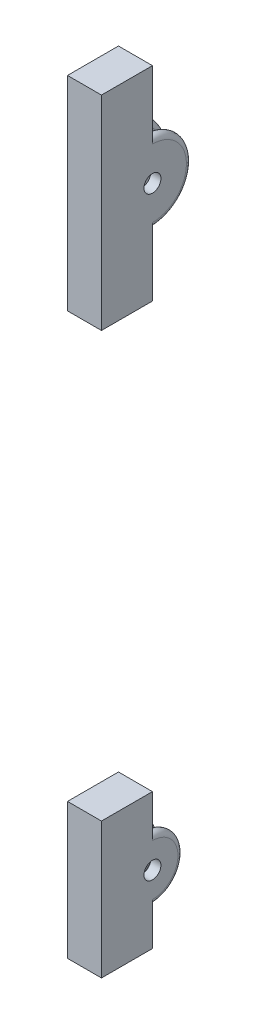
ISO-10303-21;
HEADER;
FILE_DESCRIPTION(('STEP AP214'),'2;1');
FILE_NAME('part.step','',(''),(''),'','','');
FILE_SCHEMA(('AUTOMOTIVE_DESIGN { 1 0 10303 214 1 1 1 1 }'));
ENDSEC;
DATA;
#1=APPLICATION_CONTEXT('core data for automotive mechanical design processes');
#2=APPLICATION_PROTOCOL_DEFINITION('international standard','automotive_design',2000,#1);
#3=PRODUCT_CONTEXT('',#1,'mechanical');
#4=PRODUCT('Part','Part','',(#3));
#5=PRODUCT_RELATED_PRODUCT_CATEGORY('part','',(#4));
#6=PRODUCT_DEFINITION_FORMATION('','',#4);
#7=PRODUCT_DEFINITION_CONTEXT('part definition',#1,'design');
#8=PRODUCT_DEFINITION('design','',#6,#7);
#9=PRODUCT_DEFINITION_SHAPE('','',#8);
#10=(LENGTH_UNIT() NAMED_UNIT(*) SI_UNIT(.MILLI.,.METRE.));
#11=(NAMED_UNIT(*) PLANE_ANGLE_UNIT() SI_UNIT($,.RADIAN.));
#12=(NAMED_UNIT(*) SI_UNIT($,.STERADIAN.) SOLID_ANGLE_UNIT());
#13=UNCERTAINTY_MEASURE_WITH_UNIT(LENGTH_MEASURE(1.E-05),#10,'distance_accuracy_value','');
#14=(GEOMETRIC_REPRESENTATION_CONTEXT(3) GLOBAL_UNCERTAINTY_ASSIGNED_CONTEXT((#13)) GLOBAL_UNIT_ASSIGNED_CONTEXT((#10,
#11,#12)) REPRESENTATION_CONTEXT('',''));
#15=CARTESIAN_POINT('',(0.,0.,0.));
#16=DIRECTION('',(0.,0.,1.));
#17=DIRECTION('',(1.,0.,0.));
#18=AXIS2_PLACEMENT_3D('',#15,#16,#17);
#19=CARTESIAN_POINT('',(0.,0.,0.));
#20=DIRECTION('',(0.,0.,1.));
#21=DIRECTION('',(1.,0.,0.));
#22=AXIS2_PLACEMENT_3D('',#19,#20,#21);
#23=PLANE('',#22);
#24=DIRECTION('',(1.,0.,0.));
#25=VECTOR('',#24,1.);
#26=CARTESIAN_POINT('',(4.00000000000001,-365.,0.));
#27=LINE('',#26,#25);
#28=CARTESIAN_POINT('',(4.00000000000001,-365.,0.));
#29=VERTEX_POINT('',#28);
#30=CARTESIAN_POINT('',(-4.00000000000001,-365.,0.));
#31=VERTEX_POINT('',#30);
#32=EDGE_CURVE('E117',#29,#31,#27,.F.);
#33=ORIENTED_EDGE('',*,*,#32,.F.);
#34=CARTESIAN_POINT('',(7.00000000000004,-365.,0.));
#35=DIRECTION('',(0.,0.,1.));
#36=DIRECTION('',(1.,0.,0.));
#37=AXIS2_PLACEMENT_3D('',#34,#35,#36);
#38=CIRCLE('',#37,3.00000000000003);
#39=CARTESIAN_POINT('',(10.,-365.,0.));
#40=VERTEX_POINT('',#39);
#41=EDGE_CURVE('E134',#40,#29,#38,.F.);
#42=ORIENTED_EDGE('',*,*,#41,.F.);
#43=DIRECTION('',(0.,1.,0.));
#44=VECTOR('',#43,1.);
#45=CARTESIAN_POINT('',(9.99999999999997,-310.,0.));
#46=LINE('',#45,#44);
#47=CARTESIAN_POINT('',(10.0000000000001,-390.,0.));
#48=VERTEX_POINT('',#47);
#49=EDGE_CURVE('E161',#48,#40,#46,.T.);
#50=ORIENTED_EDGE('',*,*,#49,.F.);
#51=DIRECTION('',(1.,0.,0.));
#52=VECTOR('',#51,1.);
#53=CARTESIAN_POINT('',(-10.,-390.,0.));
#54=LINE('',#53,#52);
#55=CARTESIAN_POINT('',(-10.,-390.,0.));
#56=VERTEX_POINT('',#55);
#57=EDGE_CURVE('E159',#56,#48,#54,.T.);
#58=ORIENTED_EDGE('',*,*,#57,.F.);
#59=DIRECTION('',(0.,-1.,0.));
#60=VECTOR('',#59,1.);
#61=CARTESIAN_POINT('',(-10.,-310.,0.));
#62=LINE('',#61,#60);
#63=CARTESIAN_POINT('',(-10.,-365.,0.));
#64=VERTEX_POINT('',#63);
#65=EDGE_CURVE('E70',#64,#56,#62,.T.);
#66=ORIENTED_EDGE('',*,*,#65,.F.);
#67=CARTESIAN_POINT('',(-7.00000000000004,-365.,0.));
#68=DIRECTION('',(0.,0.,1.));
#69=DIRECTION('',(1.,0.,0.));
#70=AXIS2_PLACEMENT_3D('',#67,#68,#69);
#71=CIRCLE('',#70,3.00000000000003);
#72=EDGE_CURVE('E12',#31,#64,#71,.F.);
#73=ORIENTED_EDGE('',*,*,#72,.F.);
#74=EDGE_LOOP('',(#33,#42,#50,#58,#66,#73));
#75=FACE_BOUND('',#74,.T.);
#76=ADVANCED_FACE('F46',(#75),#23,.F.);
#77=DIRECTION('',(1.,0.,0.));
#78=VECTOR('',#77,1.);
#79=CARTESIAN_POINT('',(4.00000000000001,-335.,0.));
#80=LINE('',#79,#78);
#81=CARTESIAN_POINT('',(-4.00000000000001,-335.,0.));
#82=VERTEX_POINT('',#81);
#83=CARTESIAN_POINT('',(4.00000000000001,-335.,0.));
#84=VERTEX_POINT('',#83);
#85=EDGE_CURVE('E109',#82,#84,#80,.T.);
#86=ORIENTED_EDGE('',*,*,#85,.F.);
#87=CARTESIAN_POINT('',(-7.00000000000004,-335.,0.));
#88=DIRECTION('',(0.,0.,1.));
#89=DIRECTION('',(1.,0.,0.));
#90=AXIS2_PLACEMENT_3D('',#87,#88,#89);
#91=CIRCLE('',#90,3.00000000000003);
#92=CARTESIAN_POINT('',(-10.,-335.,0.));
#93=VERTEX_POINT('',#92);
#94=EDGE_CURVE('E55',#93,#82,#91,.F.);
#95=ORIENTED_EDGE('',*,*,#94,.F.);
#96=CARTESIAN_POINT('',(-10.,-310.,0.));
#97=VERTEX_POINT('',#96);
#98=EDGE_CURVE('E141',#97,#93,#62,.T.);
#99=ORIENTED_EDGE('',*,*,#98,.F.);
#100=DIRECTION('',(-1.,0.,0.));
#101=VECTOR('',#100,1.);
#102=CARTESIAN_POINT('',(-10.,-310.,0.));
#103=LINE('',#102,#101);
#104=CARTESIAN_POINT('',(9.99999999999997,-310.,0.));
#105=VERTEX_POINT('',#104);
#106=EDGE_CURVE('E151',#105,#97,#103,.T.);
#107=ORIENTED_EDGE('',*,*,#106,.F.);
#108=CARTESIAN_POINT('',(10.0000000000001,-335.,0.));
#109=VERTEX_POINT('',#108);
#110=EDGE_CURVE('E130',#109,#105,#46,.T.);
#111=ORIENTED_EDGE('',*,*,#110,.F.);
#112=CARTESIAN_POINT('',(7.00000000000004,-335.,0.));
#113=DIRECTION('',(0.,0.,1.));
#114=DIRECTION('',(1.,0.,0.));
#115=AXIS2_PLACEMENT_3D('',#112,#113,#114);
#116=CIRCLE('',#115,3.00000000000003);
#117=EDGE_CURVE('E127',#84,#109,#116,.F.);
#118=ORIENTED_EDGE('',*,*,#117,.F.);
#119=EDGE_LOOP('',(#86,#95,#99,#107,#111,#118));
#120=FACE_BOUND('',#119,.T.);
#121=ADVANCED_FACE('F128',(#120),#23,.F.);
#122=CARTESIAN_POINT('',(-10.,-310.,30.));
#123=DIRECTION('',(1.,0.,0.));
#124=DIRECTION('',(0.,0.,-1.));
#125=AXIS2_PLACEMENT_3D('',#122,#123,#124);
#126=PLANE('',#125);
#127=CARTESIAN_POINT('',(-10.0000000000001,-350.,0.));
#128=DIRECTION('',(1.,0.,0.));
#129=DIRECTION('',(0.,0.,-1.));
#130=AXIS2_PLACEMENT_3D('',#127,#128,#129);
#131=CIRCLE('',#130,5.);
#132=CARTESIAN_POINT('',(-10.0000000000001,-350.,-5.));
#133=VERTEX_POINT('',#132);
#134=EDGE_CURVE('E192',#133,#133,#131,.T.);
#135=ORIENTED_EDGE('',*,*,#134,.T.);
#136=EDGE_LOOP('',(#135));
#137=FACE_BOUND('',#136,.T.);
#138=ORIENTED_EDGE('',*,*,#98,.T.);
#139=CARTESIAN_POINT('',(-10.0000000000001,-350.,0.));
#140=DIRECTION('',(1.,0.,0.));
#141=DIRECTION('',(0.,0.,-1.));
#142=AXIS2_PLACEMENT_3D('',#139,#140,#141);
#143=CIRCLE('',#142,15.);
#144=EDGE_CURVE('E143',#64,#93,#143,.T.);
#145=ORIENTED_EDGE('',*,*,#144,.F.);
#146=ORIENTED_EDGE('',*,*,#65,.T.);
#147=DIRECTION('',(0.,0.,-1.));
#148=VECTOR('',#147,1.);
#149=CARTESIAN_POINT('',(-10.,-390.,30.));
#150=LINE('',#149,#148);
#151=CARTESIAN_POINT('',(-10.,-390.,30.));
#152=VERTEX_POINT('',#151);
#153=EDGE_CURVE('E135',#152,#56,#150,.T.);
#154=ORIENTED_EDGE('',*,*,#153,.F.);
#155=DIRECTION('',(0.,-1.,0.));
#156=VECTOR('',#155,1.);
#157=CARTESIAN_POINT('',(-10.,-310.,30.));
#158=LINE('',#157,#156);
#159=CARTESIAN_POINT('',(-10.,-310.,30.));
#160=VERTEX_POINT('',#159);
#161=EDGE_CURVE('E147',#160,#152,#158,.T.);
#162=ORIENTED_EDGE('',*,*,#161,.F.);
#163=DIRECTION('',(0.,0.,-1.));
#164=VECTOR('',#163,1.);
#165=CARTESIAN_POINT('',(-10.,-310.,30.));
#166=LINE('',#165,#164);
#167=EDGE_CURVE('E156',#160,#97,#166,.T.);
#168=ORIENTED_EDGE('',*,*,#167,.T.);
#169=EDGE_LOOP('',(#138,#145,#146,#154,#162,#168));
#170=FACE_BOUND('',#169,.T.);
#171=ADVANCED_FACE('F48',(#137,#170),#126,.F.);
#172=CARTESIAN_POINT('',(-10.,-390.,30.));
#173=DIRECTION('',(0.,1.,0.));
#174=DIRECTION('',(0.,0.,1.));
#175=AXIS2_PLACEMENT_3D('',#172,#173,#174);
#176=PLANE('',#175);
#177=ORIENTED_EDGE('',*,*,#57,.T.);
#178=DIRECTION('',(0.,0.,-1.));
#179=VECTOR('',#178,1.);
#180=CARTESIAN_POINT('',(10.0000000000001,-390.,30.));
#181=LINE('',#180,#179);
#182=CARTESIAN_POINT('',(10.0000000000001,-390.,30.));
#183=VERTEX_POINT('',#182);
#184=EDGE_CURVE('E170',#183,#48,#181,.T.);
#185=ORIENTED_EDGE('',*,*,#184,.F.);
#186=DIRECTION('',(1.,0.,0.));
#187=VECTOR('',#186,1.);
#188=CARTESIAN_POINT('',(-10.,-390.,30.));
#189=LINE('',#188,#187);
#190=EDGE_CURVE('E150',#152,#183,#189,.T.);
#191=ORIENTED_EDGE('',*,*,#190,.F.);
#192=ORIENTED_EDGE('',*,*,#153,.T.);
#193=EDGE_LOOP('',(#177,#185,#191,#192));
#194=FACE_BOUND('',#193,.T.);
#195=ADVANCED_FACE('F206',(#194),#176,.F.);
#196=CARTESIAN_POINT('',(9.99999999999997,-310.,30.));
#197=DIRECTION('',(-1.,0.,0.));
#198=DIRECTION('',(0.,-1.,0.));
#199=AXIS2_PLACEMENT_3D('',#196,#197,#198);
#200=PLANE('',#199);
#201=CARTESIAN_POINT('',(10.0000000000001,-350.,0.));
#202=DIRECTION('',(1.,0.,0.));
#203=DIRECTION('',(0.,0.,-1.));
#204=AXIS2_PLACEMENT_3D('',#201,#202,#203);
#205=CIRCLE('',#204,5.);
#206=CARTESIAN_POINT('',(10.0000000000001,-350.,-5.));
#207=VERTEX_POINT('',#206);
#208=EDGE_CURVE('E195',#207,#207,#205,.T.);
#209=ORIENTED_EDGE('',*,*,#208,.F.);
#210=EDGE_LOOP('',(#209));
#211=FACE_BOUND('',#210,.T.);
#212=ORIENTED_EDGE('',*,*,#49,.T.);
#213=CARTESIAN_POINT('',(10.0000000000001,-350.,0.));
#214=DIRECTION('',(1.,0.,0.));
#215=DIRECTION('',(0.,0.,-1.));
#216=AXIS2_PLACEMENT_3D('',#213,#214,#215);
#217=CIRCLE('',#216,15.);
#218=EDGE_CURVE('E139',#40,#109,#217,.T.);
#219=ORIENTED_EDGE('',*,*,#218,.T.);
#220=ORIENTED_EDGE('',*,*,#110,.T.);
#221=DIRECTION('',(0.,0.,-1.));
#222=VECTOR('',#221,1.);
#223=CARTESIAN_POINT('',(9.99999999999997,-310.,30.));
#224=LINE('',#223,#222);
#225=CARTESIAN_POINT('',(9.99999999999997,-310.,30.));
#226=VERTEX_POINT('',#225);
#227=EDGE_CURVE('E167',#226,#105,#224,.T.);
#228=ORIENTED_EDGE('',*,*,#227,.F.);
#229=DIRECTION('',(0.,1.,0.));
#230=VECTOR('',#229,1.);
#231=CARTESIAN_POINT('',(9.99999999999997,-310.,30.));
#232=LINE('',#231,#230);
#233=EDGE_CURVE('E153',#183,#226,#232,.T.);
#234=ORIENTED_EDGE('',*,*,#233,.F.);
#235=ORIENTED_EDGE('',*,*,#184,.T.);
#236=EDGE_LOOP('',(#212,#219,#220,#228,#234,#235));
#237=FACE_BOUND('',#236,.T.);
#238=ADVANCED_FACE('F202',(#211,#237),#200,.F.);
#239=CARTESIAN_POINT('',(-10.,-310.,30.));
#240=DIRECTION('',(0.,-1.,0.));
#241=DIRECTION('',(0.,0.,-1.));
#242=AXIS2_PLACEMENT_3D('',#239,#240,#241);
#243=PLANE('',#242);
#244=ORIENTED_EDGE('',*,*,#106,.T.);
#245=ORIENTED_EDGE('',*,*,#167,.F.);
#246=DIRECTION('',(-1.,0.,0.));
#247=VECTOR('',#246,1.);
#248=CARTESIAN_POINT('',(-10.,-310.,30.));
#249=LINE('',#248,#247);
#250=EDGE_CURVE('E155',#226,#160,#249,.T.);
#251=ORIENTED_EDGE('',*,*,#250,.F.);
#252=ORIENTED_EDGE('',*,*,#227,.T.);
#253=EDGE_LOOP('',(#244,#245,#251,#252));
#254=FACE_BOUND('',#253,.T.);
#255=ADVANCED_FACE('F205',(#254),#243,.F.);
#256=CARTESIAN_POINT('',(0.,0.,30.));
#257=DIRECTION('',(0.,0.,1.));
#258=DIRECTION('',(1.,0.,0.));
#259=AXIS2_PLACEMENT_3D('',#256,#257,#258);
#260=PLANE('',#259);
#261=ORIENTED_EDGE('',*,*,#161,.T.);
#262=ORIENTED_EDGE('',*,*,#190,.T.);
#263=ORIENTED_EDGE('',*,*,#233,.T.);
#264=ORIENTED_EDGE('',*,*,#250,.T.);
#265=EDGE_LOOP('',(#261,#262,#263,#264));
#266=FACE_BOUND('',#265,.T.);
#267=ADVANCED_FACE('F219',(#266),#260,.T.);
#268=CARTESIAN_POINT('',(4.00000000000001,-350.,0.));
#269=DIRECTION('',(1.,0.,0.));
#270=DIRECTION('',(0.,0.,-1.));
#271=AXIS2_PLACEMENT_3D('',#268,#269,#270);
#272=PLANE('',#271);
#273=CARTESIAN_POINT('',(4.00000000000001,-350.,0.));
#274=DIRECTION('',(1.,0.,0.));
#275=DIRECTION('',(0.,0.,-1.));
#276=AXIS2_PLACEMENT_3D('',#273,#274,#275);
#277=CIRCLE('',#276,5.);
#278=CARTESIAN_POINT('',(4.00000000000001,-350.,-5.));
#279=VERTEX_POINT('',#278);
#280=EDGE_CURVE('E124',#279,#279,#277,.T.);
#281=ORIENTED_EDGE('',*,*,#280,.T.);
#282=EDGE_LOOP('',(#281));
#283=FACE_BOUND('',#282,.T.);
#284=CARTESIAN_POINT('',(4.00000000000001,-350.,0.));
#285=DIRECTION('',(1.,0.,0.));
#286=DIRECTION('',(0.,0.,-1.));
#287=AXIS2_PLACEMENT_3D('',#284,#285,#286);
#288=CIRCLE('',#287,15.);
#289=EDGE_CURVE('E123',#29,#84,#288,.T.);
#290=ORIENTED_EDGE('',*,*,#289,.F.);
#291=CARTESIAN_POINT('',(4.00000000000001,-350.,0.));
#292=DIRECTION('',(1.,0.,0.));
#293=DIRECTION('',(0.,0.,-1.));
#294=AXIS2_PLACEMENT_3D('',#291,#292,#293);
#295=CIRCLE('',#294,15.);
#296=EDGE_CURVE('E112',#84,#29,#295,.T.);
#297=ORIENTED_EDGE('',*,*,#296,.F.);
#298=EDGE_LOOP('',(#290,#297));
#299=FACE_BOUND('',#298,.T.);
#300=ADVANCED_FACE('F121',(#283,#299),#272,.F.);
#301=CARTESIAN_POINT('',(7.00000000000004,-350.,0.));
#302=DIRECTION('',(1.,0.,0.));
#303=DIRECTION('',(0.,0.,-1.));
#304=AXIS2_PLACEMENT_3D('',#301,#302,#303);
#305=TOROIDAL_SURFACE('',#304,15.,3.00000000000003);
#306=ORIENTED_EDGE('',*,*,#218,.F.);
#307=ORIENTED_EDGE('',*,*,#41,.T.);
#308=ORIENTED_EDGE('',*,*,#289,.T.);
#309=ORIENTED_EDGE('',*,*,#117,.T.);
#310=EDGE_LOOP('',(#306,#307,#308,#309));
#311=FACE_BOUND('',#310,.T.);
#312=ADVANCED_FACE('F138',(#311),#305,.T.);
#313=CARTESIAN_POINT('',(-7.00000000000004,-350.,0.));
#314=DIRECTION('',(1.,0.,0.));
#315=DIRECTION('',(0.,0.,-1.));
#316=AXIS2_PLACEMENT_3D('',#313,#314,#315);
#317=TOROIDAL_SURFACE('',#316,15.,3.00000000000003);
#318=CARTESIAN_POINT('',(-4.00000000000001,-350.,0.));
#319=DIRECTION('',(1.,0.,0.));
#320=DIRECTION('',(0.,0.,-1.));
#321=AXIS2_PLACEMENT_3D('',#318,#319,#320);
#322=CIRCLE('',#321,15.);
#323=EDGE_CURVE('E181',#31,#82,#322,.T.);
#324=ORIENTED_EDGE('',*,*,#323,.F.);
#325=ORIENTED_EDGE('',*,*,#72,.T.);
#326=ORIENTED_EDGE('',*,*,#144,.T.);
#327=ORIENTED_EDGE('',*,*,#94,.T.);
#328=EDGE_LOOP('',(#324,#325,#326,#327));
#329=FACE_BOUND('',#328,.T.);
#330=ADVANCED_FACE('F180',(#329),#317,.T.);
#331=CARTESIAN_POINT('',(-4.00000000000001,-350.,0.));
#332=DIRECTION('',(-1.,0.,0.));
#333=DIRECTION('',(0.,0.,1.));
#334=AXIS2_PLACEMENT_3D('',#331,#332,#333);
#335=PLANE('',#334);
#336=CARTESIAN_POINT('',(-4.00000000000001,-350.,0.));
#337=DIRECTION('',(-1.,0.,0.));
#338=DIRECTION('',(0.,0.,1.));
#339=AXIS2_PLACEMENT_3D('',#336,#337,#338);
#340=CIRCLE('',#339,5.);
#341=CARTESIAN_POINT('',(-4.00000000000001,-350.,5.));
#342=VERTEX_POINT('',#341);
#343=EDGE_CURVE('E50',#342,#342,#340,.T.);
#344=ORIENTED_EDGE('',*,*,#343,.T.);
#345=EDGE_LOOP('',(#344));
#346=FACE_BOUND('',#345,.T.);
#347=ORIENTED_EDGE('',*,*,#323,.T.);
#348=CARTESIAN_POINT('',(-4.00000000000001,-350.,0.));
#349=DIRECTION('',(1.,0.,0.));
#350=DIRECTION('',(0.,0.,-1.));
#351=AXIS2_PLACEMENT_3D('',#348,#349,#350);
#352=CIRCLE('',#351,15.);
#353=EDGE_CURVE('E62',#82,#31,#352,.T.);
#354=ORIENTED_EDGE('',*,*,#353,.T.);
#355=EDGE_LOOP('',(#347,#354));
#356=FACE_BOUND('',#355,.T.);
#357=ADVANCED_FACE('F185',(#346,#356),#335,.F.);
#358=CARTESIAN_POINT('',(4.00000000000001,-350.,0.));
#359=DIRECTION('',(1.,0.,0.));
#360=DIRECTION('',(0.,0.,-1.));
#361=AXIS2_PLACEMENT_3D('',#358,#359,#360);
#362=CYLINDRICAL_SURFACE('',#361,15.);
#363=ORIENTED_EDGE('',*,*,#32,.T.);
#364=ORIENTED_EDGE('',*,*,#353,.F.);
#365=ORIENTED_EDGE('',*,*,#85,.T.);
#366=ORIENTED_EDGE('',*,*,#296,.T.);
#367=EDGE_LOOP('',(#363,#364,#365,#366));
#368=FACE_BOUND('',#367,.T.);
#369=ADVANCED_FACE('F111',(#368),#362,.F.);
#370=CARTESIAN_POINT('',(-10.0000000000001,-350.,0.));
#371=DIRECTION('',(1.,0.,0.));
#372=DIRECTION('',(0.,0.,-1.));
#373=AXIS2_PLACEMENT_3D('',#370,#371,#372);
#374=CYLINDRICAL_SURFACE('',#373,5.);
#375=ORIENTED_EDGE('',*,*,#134,.F.);
#376=EDGE_LOOP('',(#375));
#377=FACE_BOUND('',#376,.T.);
#378=ORIENTED_EDGE('',*,*,#343,.F.);
#379=EDGE_LOOP('',(#378));
#380=FACE_BOUND('',#379,.T.);
#381=ADVANCED_FACE('F254',(#377,#380),#374,.F.);
#382=ORIENTED_EDGE('',*,*,#208,.T.);
#383=EDGE_LOOP('',(#382));
#384=FACE_BOUND('',#383,.T.);
#385=ORIENTED_EDGE('',*,*,#280,.F.);
#386=EDGE_LOOP('',(#385));
#387=FACE_BOUND('',#386,.T.);
#388=ADVANCED_FACE('F199',(#384,#387),#374,.F.);
#389=CLOSED_SHELL('',(#76,#121,#171,#195,#238,#255,#267,#300,#312,#330,#357,#369,#381,#388));
#390=MANIFOLD_SOLID_BREP('B2',#389);
#391=CARTESIAN_POINT('',(0.,0.,0.));
#392=DIRECTION('',(0.,0.,1.));
#393=DIRECTION('',(1.,0.,0.));
#394=AXIS2_PLACEMENT_3D('',#391,#392,#393);
#395=PLANE('',#394);
#396=DIRECTION('',(1.,0.,0.));
#397=VECTOR('',#396,1.);
#398=CARTESIAN_POINT('',(34.6789119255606,-20.,0.));
#399=LINE('',#398,#397);
#400=CARTESIAN_POINT('',(4.00000000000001,-20.,1.39659253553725E-13));
#401=VERTEX_POINT('',#400);
#402=CARTESIAN_POINT('',(-4.,-20.,1.39659253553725E-13));
#403=VERTEX_POINT('',#402);
#404=EDGE_CURVE('E426',#401,#403,#399,.F.);
#405=ORIENTED_EDGE('',*,*,#404,.F.);
#406=CARTESIAN_POINT('',(7.,-20.,1.39659253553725E-13));
#407=DIRECTION('',(0.,0.,1.));
#408=DIRECTION('',(-1.,0.,0.));
#409=AXIS2_PLACEMENT_3D('',#406,#407,#408);
#410=CIRCLE('',#409,3.);
#411=CARTESIAN_POINT('',(10.,-20.,0.));
#412=VERTEX_POINT('',#411);
#413=EDGE_CURVE('E444',#401,#412,#410,.T.);
#414=ORIENTED_EDGE('',*,*,#413,.T.);
#415=DIRECTION('',(0.,1.,0.));
#416=VECTOR('',#415,1.);
#417=CARTESIAN_POINT('',(10.,60.,0.));
#418=LINE('',#417,#416);
#419=CARTESIAN_POINT('',(10.,-60.,0.));
#420=VERTEX_POINT('',#419);
#421=EDGE_CURVE('E468',#420,#412,#418,.T.);
#422=ORIENTED_EDGE('',*,*,#421,.F.);
#423=DIRECTION('',(1.,0.,0.));
#424=VECTOR('',#423,1.);
#425=CARTESIAN_POINT('',(-10.,-60.,0.));
#426=LINE('',#425,#424);
#427=CARTESIAN_POINT('',(-10.,-60.,0.));
#428=VERTEX_POINT('',#427);
#429=EDGE_CURVE('E466',#428,#420,#426,.T.);
#430=ORIENTED_EDGE('',*,*,#429,.F.);
#431=DIRECTION('',(0.,-1.,0.));
#432=VECTOR('',#431,1.);
#433=CARTESIAN_POINT('',(-10.,60.,0.));
#434=LINE('',#433,#432);
#435=CARTESIAN_POINT('',(-10.,-20.,0.));
#436=VERTEX_POINT('',#435);
#437=EDGE_CURVE('E366',#436,#428,#434,.T.);
#438=ORIENTED_EDGE('',*,*,#437,.F.);
#439=CARTESIAN_POINT('',(-7.00000000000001,-20.,1.39659253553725E-13));
#440=DIRECTION('',(0.,0.,1.));
#441=DIRECTION('',(1.,0.,0.));
#442=AXIS2_PLACEMENT_3D('',#439,#440,#441);
#443=CIRCLE('',#442,3.);
#444=EDGE_CURVE('E502',#436,#403,#443,.T.);
#445=ORIENTED_EDGE('',*,*,#444,.T.);
#446=EDGE_LOOP('',(#405,#414,#422,#430,#438,#445));
#447=FACE_BOUND('',#446,.T.);
#448=ADVANCED_FACE('F351',(#447),#395,.F.);
#449=DIRECTION('',(1.,0.,0.));
#450=VECTOR('',#449,1.);
#451=CARTESIAN_POINT('',(34.6789119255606,20.,0.));
#452=LINE('',#451,#450);
#453=CARTESIAN_POINT('',(-4.,20.,-1.39659253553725E-13));
#454=VERTEX_POINT('',#453);
#455=CARTESIAN_POINT('',(4.00000000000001,20.,0.));
#456=VERTEX_POINT('',#455);
#457=EDGE_CURVE('E417',#454,#456,#452,.T.);
#458=ORIENTED_EDGE('',*,*,#457,.F.);
#459=CARTESIAN_POINT('',(-7.,20.,0.));
#460=DIRECTION('',(0.,0.,-1.));
#461=DIRECTION('',(1.,0.,0.));
#462=AXIS2_PLACEMENT_3D('',#459,#460,#461);
#463=CIRCLE('',#462,3.);
#464=CARTESIAN_POINT('',(-10.,20.,0.));
#465=VERTEX_POINT('',#464);
#466=EDGE_CURVE('E374',#465,#454,#463,.T.);
#467=ORIENTED_EDGE('',*,*,#466,.F.);
#468=CARTESIAN_POINT('',(-10.,60.,0.));
#469=VERTEX_POINT('',#468);
#470=EDGE_CURVE('E450',#469,#465,#434,.T.);
#471=ORIENTED_EDGE('',*,*,#470,.F.);
#472=DIRECTION('',(-1.,0.,0.));
#473=VECTOR('',#472,1.);
#474=CARTESIAN_POINT('',(-10.,60.,0.));
#475=LINE('',#474,#473);
#476=CARTESIAN_POINT('',(10.,60.,0.));
#477=VERTEX_POINT('',#476);
#478=EDGE_CURVE('E459',#477,#469,#475,.T.);
#479=ORIENTED_EDGE('',*,*,#478,.F.);
#480=CARTESIAN_POINT('',(10.,20.,0.));
#481=VERTEX_POINT('',#480);
#482=EDGE_CURVE('E440',#481,#477,#418,.T.);
#483=ORIENTED_EDGE('',*,*,#482,.F.);
#484=CARTESIAN_POINT('',(7.,20.,0.));
#485=DIRECTION('',(0.,0.,-1.));
#486=DIRECTION('',(-1.,0.,0.));
#487=AXIS2_PLACEMENT_3D('',#484,#485,#486);
#488=CIRCLE('',#487,3.);
#489=EDGE_CURVE('E437',#456,#481,#488,.T.);
#490=ORIENTED_EDGE('',*,*,#489,.F.);
#491=EDGE_LOOP('',(#458,#467,#471,#479,#483,#490));
#492=FACE_BOUND('',#491,.T.);
#493=ADVANCED_FACE('F438',(#492),#395,.F.);
#494=CARTESIAN_POINT('',(-10.,0.,0.));
#495=DIRECTION('',(1.,0.,0.));
#496=DIRECTION('',(0.,0.,-1.));
#497=AXIS2_PLACEMENT_3D('',#494,#495,#496);
#498=CYLINDRICAL_SURFACE('',#497,5.);
#499=CARTESIAN_POINT('',(-10.,0.,0.));
#500=DIRECTION('',(1.,0.,0.));
#501=DIRECTION('',(0.,0.,-1.));
#502=AXIS2_PLACEMENT_3D('',#499,#500,#501);
#503=CIRCLE('',#502,5.);
#504=CARTESIAN_POINT('',(-10.,0.,-5.));
#505=VERTEX_POINT('',#504);
#506=EDGE_CURVE('E512',#505,#505,#503,.T.);
#507=CARTESIAN_POINT('',(-4.00000000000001,0.,0.));
#508=DIRECTION('',(-1.,0.,0.));
#509=DIRECTION('',(0.,-1.,0.));
#510=AXIS2_PLACEMENT_3D('',#507,#508,#509);
#511=CIRCLE('',#510,5.);
#512=CARTESIAN_POINT('',(-4.,0.,-5.));
#513=VERTEX_POINT('',#512);
#514=EDGE_CURVE('E44',#513,#513,#511,.T.);
#515=CARTESIAN_POINT('',(-10.,0.,-5.));
#516=CARTESIAN_POINT('',(-9.93750000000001,0.,-5.));
#517=CARTESIAN_POINT('',(-9.87500000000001,0.,-5.));
#518=CARTESIAN_POINT('',(-9.75000000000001,0.,-5.));
#519=CARTESIAN_POINT('',(-9.68750000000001,0.,-5.));
#520=CARTESIAN_POINT('',(-9.56250000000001,0.,-5.));
#521=CARTESIAN_POINT('',(-9.50000000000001,0.,-5.));
#522=CARTESIAN_POINT('',(-9.37500000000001,0.,-5.));
#523=CARTESIAN_POINT('',(-9.31250000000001,0.,-5.));
#524=CARTESIAN_POINT('',(-9.18750000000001,0.,-5.));
#525=CARTESIAN_POINT('',(-9.12500000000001,0.,-5.));
#526=CARTESIAN_POINT('',(-9.00000000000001,0.,-5.));
#527=CARTESIAN_POINT('',(-8.93750000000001,0.,-5.));
#528=CARTESIAN_POINT('',(-8.81250000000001,0.,-5.));
#529=CARTESIAN_POINT('',(-8.75000000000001,0.,-5.));
#530=CARTESIAN_POINT('',(-8.62500000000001,0.,-5.));
#531=CARTESIAN_POINT('',(-8.56250000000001,0.,-5.));
#532=CARTESIAN_POINT('',(-8.43750000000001,0.,-5.));
#533=CARTESIAN_POINT('',(-8.37500000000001,0.,-5.));
#534=CARTESIAN_POINT('',(-8.25000000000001,0.,-5.));
#535=CARTESIAN_POINT('',(-8.18750000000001,0.,-5.));
#536=CARTESIAN_POINT('',(-8.06250000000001,0.,-5.));
#537=CARTESIAN_POINT('',(-8.00000000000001,0.,-5.));
#538=CARTESIAN_POINT('',(-7.87500000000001,0.,-5.));
#539=CARTESIAN_POINT('',(-7.81250000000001,0.,-5.));
#540=CARTESIAN_POINT('',(-7.68750000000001,0.,-5.));
#541=CARTESIAN_POINT('',(-7.62500000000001,0.,-5.));
#542=CARTESIAN_POINT('',(-7.50000000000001,0.,-5.));
#543=CARTESIAN_POINT('',(-7.43750000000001,0.,-5.));
#544=CARTESIAN_POINT('',(-7.31250000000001,0.,-5.));
#545=CARTESIAN_POINT('',(-7.25000000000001,0.,-5.));
#546=CARTESIAN_POINT('',(-7.12500000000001,0.,-5.));
#547=CARTESIAN_POINT('',(-7.06250000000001,0.,-5.));
#548=CARTESIAN_POINT('',(-6.93750000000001,0.,-5.));
#549=CARTESIAN_POINT('',(-6.87500000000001,0.,-5.));
#550=CARTESIAN_POINT('',(-6.75000000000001,0.,-5.));
#551=CARTESIAN_POINT('',(-6.68750000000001,0.,-5.));
#552=CARTESIAN_POINT('',(-6.56250000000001,0.,-5.));
#553=CARTESIAN_POINT('',(-6.50000000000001,0.,-5.));
#554=CARTESIAN_POINT('',(-6.37500000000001,0.,-5.));
#555=CARTESIAN_POINT('',(-6.31250000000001,0.,-5.));
#556=CARTESIAN_POINT('',(-6.18750000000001,0.,-5.));
#557=CARTESIAN_POINT('',(-6.12500000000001,0.,-5.));
#558=CARTESIAN_POINT('',(-6.00000000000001,0.,-5.));
#559=CARTESIAN_POINT('',(-5.93750000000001,0.,-5.));
#560=CARTESIAN_POINT('',(-5.81250000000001,0.,-5.));
#561=CARTESIAN_POINT('',(-5.75000000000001,0.,-5.));
#562=CARTESIAN_POINT('',(-5.62500000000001,0.,-5.));
#563=CARTESIAN_POINT('',(-5.56250000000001,0.,-5.));
#564=CARTESIAN_POINT('',(-5.43750000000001,0.,-5.));
#565=CARTESIAN_POINT('',(-5.37500000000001,0.,-5.));
#566=CARTESIAN_POINT('',(-5.25000000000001,0.,-5.));
#567=CARTESIAN_POINT('',(-5.18750000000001,0.,-5.));
#568=CARTESIAN_POINT('',(-5.06250000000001,0.,-5.));
#569=CARTESIAN_POINT('',(-5.00000000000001,0.,-5.));
#570=CARTESIAN_POINT('',(-4.87500000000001,0.,-5.));
#571=CARTESIAN_POINT('',(-4.81250000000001,0.,-5.));
#572=CARTESIAN_POINT('',(-4.68750000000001,0.,-5.));
#573=CARTESIAN_POINT('',(-4.62500000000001,0.,-5.));
#574=CARTESIAN_POINT('',(-4.5,0.,-5.));
#575=CARTESIAN_POINT('',(-4.4375,0.,-5.));
#576=CARTESIAN_POINT('',(-4.3125,0.,-5.));
#577=CARTESIAN_POINT('',(-4.25,0.,-5.));
#578=CARTESIAN_POINT('',(-4.125,0.,-5.));
#579=CARTESIAN_POINT('',(-4.0625,0.,-5.));
#580=CARTESIAN_POINT('',(-4.,0.,-5.));
#581=B_SPLINE_CURVE_WITH_KNOTS('',3,(#515,#516,#517,#518,#519,#520,#521,#522,#523,#524,#525,
#526,#527,#528,#529,#530,#531,#532,#533,#534,#535,#536,#537,#538,#539,#540,#541,#542,#543,#544,
#545,#546,#547,#548,#549,#550,#551,#552,#553,#554,#555,#556,#557,#558,#559,#560,#561,#562,#563,
#564,#565,#566,#567,#568,#569,#570,#571,#572,#573,#574,#575,#576,#577,#578,#579,#580),
.UNSPECIFIED.,.F.,.F.,(4,2,2,2,2,2,2,2,2,2,2,2,2,2,2,2,2,2,2,2,2,2,2,2,2,2,2,2,2,2,2,2,4),(0.,
0.1875,0.375,0.5625,0.750000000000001,0.937500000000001,1.125,1.3125,1.5,1.6875,1.875,2.0625,
2.25,2.4375,2.625,2.8125,3.,3.1875,3.375,3.5625,3.75,3.9375,4.125,4.3125,4.5,4.6875,4.875,
5.0625,5.25,5.4375,5.625,5.8125,6.),.UNSPECIFIED.);
#582=EDGE_CURVE('BSEAM536',#505,#513,#581,.T.);
#583=ORIENTED_EDGE('',*,*,#506,.F.);
#584=ORIENTED_EDGE('',*,*,#514,.F.);
#585=ORIENTED_EDGE('',*,*,#582,.T.);
#586=ORIENTED_EDGE('',*,*,#582,.F.);
#587=EDGE_LOOP('',(#583,#585,#584,#586));
#588=FACE_BOUND('',#587,.T.);
#589=ADVANCED_FACE('F536',(#588),#498,.F.);
#590=CARTESIAN_POINT('',(10.,0.,0.));
#591=DIRECTION('',(1.,0.,0.));
#592=DIRECTION('',(0.,0.,-1.));
#593=AXIS2_PLACEMENT_3D('',#590,#591,#592);
#594=CIRCLE('',#593,5.);
#595=CARTESIAN_POINT('',(10.,0.,-5.));
#596=VERTEX_POINT('',#595);
#597=EDGE_CURVE('E513',#596,#596,#594,.T.);
#598=CARTESIAN_POINT('',(4.,0.,0.));
#599=DIRECTION('',(1.,0.,0.));
#600=DIRECTION('',(0.,1.,0.));
#601=AXIS2_PLACEMENT_3D('',#598,#599,#600);
#602=CIRCLE('',#601,5.);
#603=CARTESIAN_POINT('',(4.,0.,-5.));
#604=VERTEX_POINT('',#603);
#605=EDGE_CURVE('E509',#604,#604,#602,.T.);
#606=CARTESIAN_POINT('',(10.,0.,-5.));
#607=CARTESIAN_POINT('',(9.9375,0.,-5.));
#608=CARTESIAN_POINT('',(9.875,0.,-5.));
#609=CARTESIAN_POINT('',(9.75,0.,-5.));
#610=CARTESIAN_POINT('',(9.6875,0.,-5.));
#611=CARTESIAN_POINT('',(9.5625,0.,-5.));
#612=CARTESIAN_POINT('',(9.5,0.,-5.));
#613=CARTESIAN_POINT('',(9.375,0.,-5.));
#614=CARTESIAN_POINT('',(9.3125,0.,-5.));
#615=CARTESIAN_POINT('',(9.1875,0.,-5.));
#616=CARTESIAN_POINT('',(9.125,0.,-5.));
#617=CARTESIAN_POINT('',(9.,0.,-5.));
#618=CARTESIAN_POINT('',(8.9375,0.,-5.));
#619=CARTESIAN_POINT('',(8.8125,0.,-5.));
#620=CARTESIAN_POINT('',(8.75,0.,-5.));
#621=CARTESIAN_POINT('',(8.625,0.,-5.));
#622=CARTESIAN_POINT('',(8.5625,0.,-5.));
#623=CARTESIAN_POINT('',(8.4375,0.,-5.));
#624=CARTESIAN_POINT('',(8.375,0.,-5.));
#625=CARTESIAN_POINT('',(8.25,0.,-5.));
#626=CARTESIAN_POINT('',(8.1875,0.,-5.));
#627=CARTESIAN_POINT('',(8.0625,0.,-5.));
#628=CARTESIAN_POINT('',(8.,0.,-5.));
#629=CARTESIAN_POINT('',(7.875,0.,-5.));
#630=CARTESIAN_POINT('',(7.8125,0.,-5.));
#631=CARTESIAN_POINT('',(7.6875,0.,-5.));
#632=CARTESIAN_POINT('',(7.625,0.,-5.));
#633=CARTESIAN_POINT('',(7.5,0.,-5.));
#634=CARTESIAN_POINT('',(7.4375,0.,-5.));
#635=CARTESIAN_POINT('',(7.3125,0.,-5.));
#636=CARTESIAN_POINT('',(7.25,0.,-5.));
#637=CARTESIAN_POINT('',(7.125,0.,-5.));
#638=CARTESIAN_POINT('',(7.0625,0.,-5.));
#639=CARTESIAN_POINT('',(6.9375,0.,-5.));
#640=CARTESIAN_POINT('',(6.875,0.,-5.));
#641=CARTESIAN_POINT('',(6.75,0.,-5.));
#642=CARTESIAN_POINT('',(6.6875,0.,-5.));
#643=CARTESIAN_POINT('',(6.5625,0.,-5.));
#644=CARTESIAN_POINT('',(6.5,0.,-5.));
#645=CARTESIAN_POINT('',(6.375,0.,-5.));
#646=CARTESIAN_POINT('',(6.3125,0.,-5.));
#647=CARTESIAN_POINT('',(6.1875,0.,-5.));
#648=CARTESIAN_POINT('',(6.125,0.,-5.));
#649=CARTESIAN_POINT('',(6.,0.,-5.));
#650=CARTESIAN_POINT('',(5.9375,0.,-5.));
#651=CARTESIAN_POINT('',(5.8125,0.,-5.));
#652=CARTESIAN_POINT('',(5.75,0.,-5.));
#653=CARTESIAN_POINT('',(5.625,0.,-5.));
#654=CARTESIAN_POINT('',(5.5625,0.,-5.));
#655=CARTESIAN_POINT('',(5.4375,0.,-5.));
#656=CARTESIAN_POINT('',(5.375,0.,-5.));
#657=CARTESIAN_POINT('',(5.25,0.,-5.));
#658=CARTESIAN_POINT('',(5.1875,0.,-5.));
#659=CARTESIAN_POINT('',(5.0625,0.,-5.));
#660=CARTESIAN_POINT('',(5.,0.,-5.));
#661=CARTESIAN_POINT('',(4.875,0.,-5.));
#662=CARTESIAN_POINT('',(4.8125,0.,-5.));
#663=CARTESIAN_POINT('',(4.6875,0.,-5.));
#664=CARTESIAN_POINT('',(4.625,0.,-5.));
#665=CARTESIAN_POINT('',(4.5,0.,-5.));
#666=CARTESIAN_POINT('',(4.4375,0.,-5.));
#667=CARTESIAN_POINT('',(4.3125,0.,-5.));
#668=CARTESIAN_POINT('',(4.25,0.,-5.));
#669=CARTESIAN_POINT('',(4.125,0.,-5.));
#670=CARTESIAN_POINT('',(4.0625,0.,-5.));
#671=CARTESIAN_POINT('',(4.,0.,-5.));
#672=B_SPLINE_CURVE_WITH_KNOTS('',3,(#606,#607,#608,#609,#610,#611,#612,#613,#614,#615,#616,
#617,#618,#619,#620,#621,#622,#623,#624,#625,#626,#627,#628,#629,#630,#631,#632,#633,#634,#635,
#636,#637,#638,#639,#640,#641,#642,#643,#644,#645,#646,#647,#648,#649,#650,#651,#652,#653,#654,
#655,#656,#657,#658,#659,#660,#661,#662,#663,#664,#665,#666,#667,#668,#669,#670,#671),
.UNSPECIFIED.,.F.,.F.,(4,2,2,2,2,2,2,2,2,2,2,2,2,2,2,2,2,2,2,2,2,2,2,2,2,2,2,2,2,2,2,2,4),(0.,
0.1875,0.375,0.5625,0.750000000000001,0.937500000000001,1.125,1.3125,1.5,1.6875,1.875,2.0625,
2.25,2.4375,2.625,2.8125,3.,3.1875,3.375,3.5625,3.75,3.9375,4.125,4.3125,4.5,4.6875,4.875,
5.0625,5.25,5.4375,5.625,5.8125,6.),.UNSPECIFIED.);
#673=EDGE_CURVE('BSEAM548',#596,#604,#672,.T.);
#674=ORIENTED_EDGE('',*,*,#597,.T.);
#675=ORIENTED_EDGE('',*,*,#605,.F.);
#676=ORIENTED_EDGE('',*,*,#673,.T.);
#677=ORIENTED_EDGE('',*,*,#673,.F.);
#678=EDGE_LOOP('',(#674,#676,#675,#677));
#679=FACE_BOUND('',#678,.T.);
#680=ADVANCED_FACE('F548',(#679),#498,.F.);
#681=CARTESIAN_POINT('',(-10.,60.,30.));
#682=DIRECTION('',(1.,0.,0.));
#683=DIRECTION('',(0.,0.,-1.));
#684=AXIS2_PLACEMENT_3D('',#681,#682,#683);
#685=PLANE('',#684);
#686=ORIENTED_EDGE('',*,*,#506,.T.);
#687=EDGE_LOOP('',(#686));
#688=FACE_BOUND('',#687,.T.);
#689=ORIENTED_EDGE('',*,*,#470,.T.);
#690=CARTESIAN_POINT('',(-10.,0.,0.));
#691=DIRECTION('',(1.,0.,0.));
#692=DIRECTION('',(0.,1.,0.));
#693=AXIS2_PLACEMENT_3D('',#690,#691,#692);
#694=CIRCLE('',#693,20.);
#695=EDGE_CURVE('E445',#436,#465,#694,.T.);
#696=ORIENTED_EDGE('',*,*,#695,.F.);
#697=ORIENTED_EDGE('',*,*,#437,.T.);
#698=DIRECTION('',(0.,0.,-1.));
#699=VECTOR('',#698,1.);
#700=CARTESIAN_POINT('',(-10.,-60.,30.));
#701=LINE('',#700,#699);
#702=CARTESIAN_POINT('',(-10.,-60.,30.));
#703=VERTEX_POINT('',#702);
#704=EDGE_CURVE('E359',#703,#428,#701,.T.);
#705=ORIENTED_EDGE('',*,*,#704,.F.);
#706=DIRECTION('',(0.,-1.,0.));
#707=VECTOR('',#706,1.);
#708=CARTESIAN_POINT('',(-10.,60.,30.));
#709=LINE('',#708,#707);
#710=CARTESIAN_POINT('',(-10.,60.,30.));
#711=VERTEX_POINT('',#710);
#712=EDGE_CURVE('E455',#711,#703,#709,.T.);
#713=ORIENTED_EDGE('',*,*,#712,.F.);
#714=DIRECTION('',(0.,0.,-1.));
#715=VECTOR('',#714,1.);
#716=CARTESIAN_POINT('',(-10.,60.,30.));
#717=LINE('',#716,#715);
#718=EDGE_CURVE('E464',#711,#469,#717,.T.);
#719=ORIENTED_EDGE('',*,*,#718,.T.);
#720=EDGE_LOOP('',(#689,#696,#697,#705,#713,#719));
#721=FACE_BOUND('',#720,.T.);
#722=ADVANCED_FACE('F353',(#688,#721),#685,.F.);
#723=CARTESIAN_POINT('',(-10.,-60.,30.));
#724=DIRECTION('',(0.,1.,0.));
#725=DIRECTION('',(0.,0.,1.));
#726=AXIS2_PLACEMENT_3D('',#723,#724,#725);
#727=PLANE('',#726);
#728=ORIENTED_EDGE('',*,*,#429,.T.);
#729=DIRECTION('',(0.,0.,-1.));
#730=VECTOR('',#729,1.);
#731=CARTESIAN_POINT('',(10.,-60.,30.));
#732=LINE('',#731,#730);
#733=CARTESIAN_POINT('',(10.,-60.,30.));
#734=VERTEX_POINT('',#733);
#735=EDGE_CURVE('E477',#734,#420,#732,.T.);
#736=ORIENTED_EDGE('',*,*,#735,.F.);
#737=DIRECTION('',(1.,0.,0.));
#738=VECTOR('',#737,1.);
#739=CARTESIAN_POINT('',(-10.,-60.,30.));
#740=LINE('',#739,#738);
#741=EDGE_CURVE('E458',#703,#734,#740,.T.);
#742=ORIENTED_EDGE('',*,*,#741,.F.);
#743=ORIENTED_EDGE('',*,*,#704,.T.);
#744=EDGE_LOOP('',(#728,#736,#742,#743));
#745=FACE_BOUND('',#744,.T.);
#746=ADVANCED_FACE('F482',(#745),#727,.F.);
#747=CARTESIAN_POINT('',(10.,60.,30.));
#748=DIRECTION('',(-1.,0.,0.));
#749=DIRECTION('',(0.,0.,1.));
#750=AXIS2_PLACEMENT_3D('',#747,#748,#749);
#751=PLANE('',#750);
#752=ORIENTED_EDGE('',*,*,#597,.F.);
#753=EDGE_LOOP('',(#752));
#754=FACE_BOUND('',#753,.T.);
#755=ORIENTED_EDGE('',*,*,#421,.T.);
#756=CARTESIAN_POINT('',(10.,0.,0.));
#757=DIRECTION('',(1.,0.,0.));
#758=DIRECTION('',(0.,1.,0.));
#759=AXIS2_PLACEMENT_3D('',#756,#757,#758);
#760=CIRCLE('',#759,20.);
#761=EDGE_CURVE('E448',#412,#481,#760,.T.);
#762=ORIENTED_EDGE('',*,*,#761,.T.);
#763=ORIENTED_EDGE('',*,*,#482,.T.);
#764=DIRECTION('',(0.,0.,-1.));
#765=VECTOR('',#764,1.);
#766=CARTESIAN_POINT('',(10.,60.,30.));
#767=LINE('',#766,#765);
#768=CARTESIAN_POINT('',(10.,60.,30.));
#769=VERTEX_POINT('',#768);
#770=EDGE_CURVE('E474',#769,#477,#767,.T.);
#771=ORIENTED_EDGE('',*,*,#770,.F.);
#772=DIRECTION('',(0.,1.,0.));
#773=VECTOR('',#772,1.);
#774=CARTESIAN_POINT('',(10.,60.,30.));
#775=LINE('',#774,#773);
#776=EDGE_CURVE('E461',#734,#769,#775,.T.);
#777=ORIENTED_EDGE('',*,*,#776,.F.);
#778=ORIENTED_EDGE('',*,*,#735,.T.);
#779=EDGE_LOOP('',(#755,#762,#763,#771,#777,#778));
#780=FACE_BOUND('',#779,.T.);
#781=ADVANCED_FACE('F490',(#754,#780),#751,.F.);
#782=CARTESIAN_POINT('',(-10.,60.,30.));
#783=DIRECTION('',(0.,-1.,0.));
#784=DIRECTION('',(1.,0.,0.));
#785=AXIS2_PLACEMENT_3D('',#782,#783,#784);
#786=PLANE('',#785);
#787=ORIENTED_EDGE('',*,*,#478,.T.);
#788=ORIENTED_EDGE('',*,*,#718,.F.);
#789=DIRECTION('',(-1.,0.,0.));
#790=VECTOR('',#789,1.);
#791=CARTESIAN_POINT('',(-10.,60.,30.));
#792=LINE('',#791,#790);
#793=EDGE_CURVE('E463',#769,#711,#792,.T.);
#794=ORIENTED_EDGE('',*,*,#793,.F.);
#795=ORIENTED_EDGE('',*,*,#770,.T.);
#796=EDGE_LOOP('',(#787,#788,#794,#795));
#797=FACE_BOUND('',#796,.T.);
#798=ADVANCED_FACE('F498',(#797),#786,.F.);
#799=CARTESIAN_POINT('',(0.,0.,30.));
#800=DIRECTION('',(0.,0.,1.));
#801=DIRECTION('',(1.,0.,0.));
#802=AXIS2_PLACEMENT_3D('',#799,#800,#801);
#803=PLANE('',#802);
#804=ORIENTED_EDGE('',*,*,#712,.T.);
#805=ORIENTED_EDGE('',*,*,#741,.T.);
#806=ORIENTED_EDGE('',*,*,#776,.T.);
#807=ORIENTED_EDGE('',*,*,#793,.T.);
#808=EDGE_LOOP('',(#804,#805,#806,#807));
#809=FACE_BOUND('',#808,.T.);
#810=ADVANCED_FACE('F495',(#809),#803,.T.);
#811=CARTESIAN_POINT('',(4.,0.,0.));
#812=DIRECTION('',(1.,0.,0.));
#813=DIRECTION('',(0.,1.,0.));
#814=AXIS2_PLACEMENT_3D('',#811,#812,#813);
#815=PLANE('',#814);
#816=CARTESIAN_POINT('',(4.,0.,0.));
#817=DIRECTION('',(1.,0.,0.));
#818=DIRECTION('',(0.,1.,0.));
#819=AXIS2_PLACEMENT_3D('',#816,#817,#818);
#820=CIRCLE('',#819,20.);
#821=EDGE_CURVE('E433',#401,#456,#820,.T.);
#822=ORIENTED_EDGE('',*,*,#821,.F.);
#823=CARTESIAN_POINT('',(4.00000000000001,0.,0.));
#824=DIRECTION('',(1.,0.,0.));
#825=DIRECTION('',(0.,0.,-1.));
#826=AXIS2_PLACEMENT_3D('',#823,#824,#825);
#827=CIRCLE('',#826,20.);
#828=EDGE_CURVE('E420',#456,#401,#827,.T.);
#829=ORIENTED_EDGE('',*,*,#828,.F.);
#830=EDGE_LOOP('',(#822,#829));
#831=FACE_BOUND('',#830,.T.);
#832=ORIENTED_EDGE('',*,*,#605,.T.);
#833=EDGE_LOOP('',(#832));
#834=FACE_BOUND('',#833,.T.);
#835=ADVANCED_FACE('F430',(#831,#834),#815,.F.);
#836=CARTESIAN_POINT('',(7.,0.,0.));
#837=DIRECTION('',(1.,0.,0.));
#838=DIRECTION('',(0.,1.,0.));
#839=AXIS2_PLACEMENT_3D('',#836,#837,#838);
#840=TOROIDAL_SURFACE('',#839,20.,3.);
#841=ORIENTED_EDGE('',*,*,#413,.F.);
#842=ORIENTED_EDGE('',*,*,#821,.T.);
#843=ORIENTED_EDGE('',*,*,#489,.T.);
#844=ORIENTED_EDGE('',*,*,#761,.F.);
#845=EDGE_LOOP('',(#841,#842,#843,#844));
#846=FACE_BOUND('',#845,.T.);
#847=ADVANCED_FACE('F447',(#846),#840,.T.);
#848=CARTESIAN_POINT('',(-7.00000000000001,0.,0.));
#849=DIRECTION('',(1.,0.,0.));
#850=DIRECTION('',(0.,1.,0.));
#851=AXIS2_PLACEMENT_3D('',#848,#849,#850);
#852=TOROIDAL_SURFACE('',#851,20.,3.);
#853=ORIENTED_EDGE('',*,*,#695,.T.);
#854=ORIENTED_EDGE('',*,*,#466,.T.);
#855=CARTESIAN_POINT('',(-4.00000000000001,0.,0.));
#856=DIRECTION('',(1.,0.,0.));
#857=DIRECTION('',(0.,1.,0.));
#858=AXIS2_PLACEMENT_3D('',#855,#856,#857);
#859=CIRCLE('',#858,20.);
#860=EDGE_CURVE('E503',#403,#454,#859,.T.);
#861=ORIENTED_EDGE('',*,*,#860,.F.);
#862=ORIENTED_EDGE('',*,*,#444,.F.);
#863=EDGE_LOOP('',(#853,#854,#861,#862));
#864=FACE_BOUND('',#863,.T.);
#865=ADVANCED_FACE('F500',(#864),#852,.T.);
#866=CARTESIAN_POINT('',(-4.00000000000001,0.,0.));
#867=DIRECTION('',(-1.,0.,0.));
#868=DIRECTION('',(0.,-1.,0.));
#869=AXIS2_PLACEMENT_3D('',#866,#867,#868);
#870=PLANE('',#869);
#871=ORIENTED_EDGE('',*,*,#514,.T.);
#872=EDGE_LOOP('',(#871));
#873=FACE_BOUND('',#872,.T.);
#874=ORIENTED_EDGE('',*,*,#860,.T.);
#875=CARTESIAN_POINT('',(-4.,0.,0.));
#876=DIRECTION('',(1.,0.,0.));
#877=DIRECTION('',(0.,0.,-1.));
#878=AXIS2_PLACEMENT_3D('',#875,#876,#877);
#879=CIRCLE('',#878,20.);
#880=EDGE_CURVE('E423',#454,#403,#879,.T.);
#881=ORIENTED_EDGE('',*,*,#880,.T.);
#882=EDGE_LOOP('',(#874,#881));
#883=FACE_BOUND('',#882,.T.);
#884=ADVANCED_FACE('F520',(#873,#883),#870,.F.);
#885=CARTESIAN_POINT('',(34.6789119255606,0.,0.));
#886=DIRECTION('',(1.,0.,0.));
#887=DIRECTION('',(0.,0.,-1.));
#888=AXIS2_PLACEMENT_3D('',#885,#886,#887);
#889=CYLINDRICAL_SURFACE('',#888,20.);
#890=ORIENTED_EDGE('',*,*,#404,.T.);
#891=ORIENTED_EDGE('',*,*,#880,.F.);
#892=ORIENTED_EDGE('',*,*,#457,.T.);
#893=ORIENTED_EDGE('',*,*,#828,.T.);
#894=EDGE_LOOP('',(#890,#891,#892,#893));
#895=FACE_BOUND('',#894,.T.);
#896=ADVANCED_FACE('F419',(#895),#889,.F.);
#897=CLOSED_SHELL('',(#448,#493,#589,#680,#722,#746,#781,#798,#810,#835,#847,#865,#884,#896));
#898=MANIFOLD_SOLID_BREP('B6',#897);
#899=ADVANCED_BREP_SHAPE_REPRESENTATION('',(#18,#390,#898),#14);
#900=SHAPE_DEFINITION_REPRESENTATION(#9,#899);
ENDSEC;
END-ISO-10303-21;
